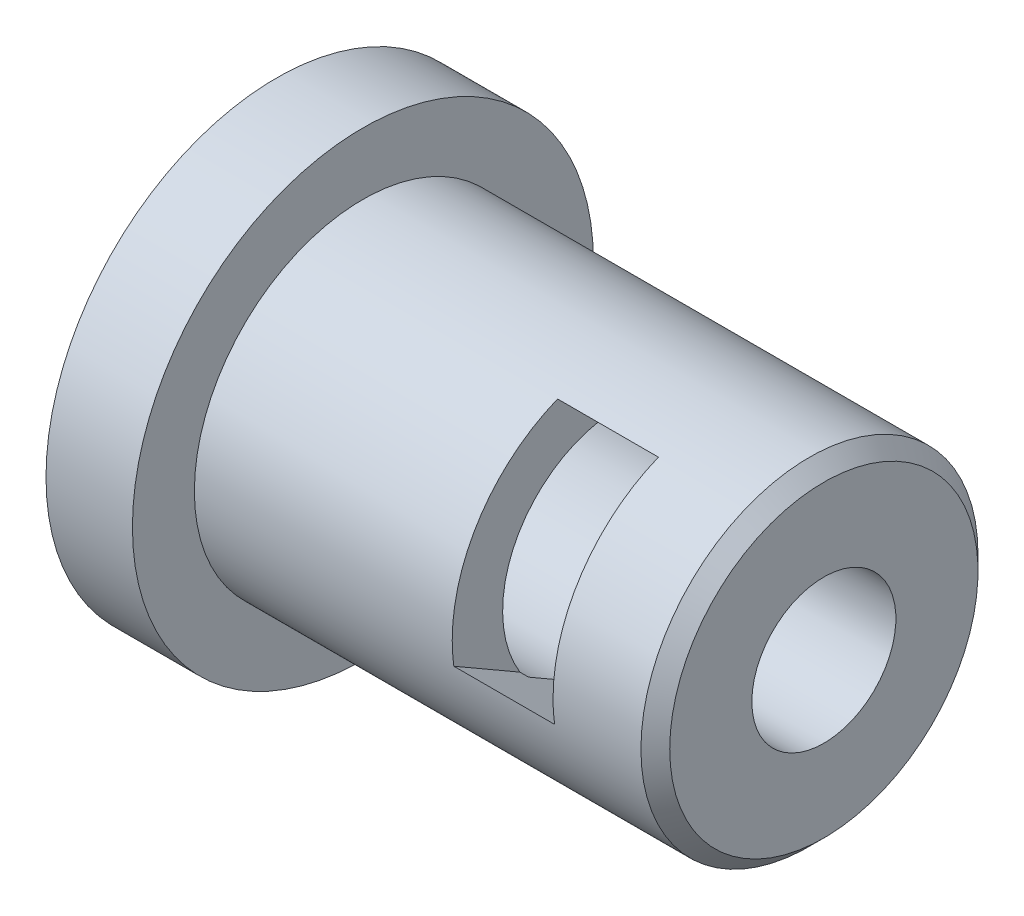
ISO-10303-21;
HEADER;
FILE_DESCRIPTION(('STEP AP214'),'2;1');
FILE_NAME('part.step','',(''),(''),'','','');
FILE_SCHEMA(('AUTOMOTIVE_DESIGN { 1 0 10303 214 1 1 1 1 }'));
ENDSEC;
DATA;
#1=APPLICATION_CONTEXT('core data for automotive mechanical design processes');
#2=APPLICATION_PROTOCOL_DEFINITION('international standard','automotive_design',2000,#1);
#3=PRODUCT_CONTEXT('',#1,'mechanical');
#4=PRODUCT('Part','Part','',(#3));
#5=PRODUCT_RELATED_PRODUCT_CATEGORY('part','',(#4));
#6=PRODUCT_DEFINITION_FORMATION('','',#4);
#7=PRODUCT_DEFINITION_CONTEXT('part definition',#1,'design');
#8=PRODUCT_DEFINITION('design','',#6,#7);
#9=PRODUCT_DEFINITION_SHAPE('','',#8);
#10=(LENGTH_UNIT() NAMED_UNIT(*) SI_UNIT(.MILLI.,.METRE.));
#11=(NAMED_UNIT(*) PLANE_ANGLE_UNIT() SI_UNIT($,.RADIAN.));
#12=(NAMED_UNIT(*) SI_UNIT($,.STERADIAN.) SOLID_ANGLE_UNIT());
#13=UNCERTAINTY_MEASURE_WITH_UNIT(LENGTH_MEASURE(1.E-05),#10,'distance_accuracy_value','');
#14=(GEOMETRIC_REPRESENTATION_CONTEXT(3) GLOBAL_UNCERTAINTY_ASSIGNED_CONTEXT((#13)) GLOBAL_UNIT_ASSIGNED_CONTEXT((#10,
#11,#12)) REPRESENTATION_CONTEXT('',''));
#15=CARTESIAN_POINT('',(0.,0.,0.));
#16=DIRECTION('',(0.,0.,1.));
#17=DIRECTION('',(1.,0.,0.));
#18=AXIS2_PLACEMENT_3D('',#15,#16,#17);
#19=CARTESIAN_POINT('',(-9.41062293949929,0.,0.));
#20=DIRECTION('',(-1.,0.,0.));
#21=DIRECTION('',(0.,0.,1.));
#22=AXIS2_PLACEMENT_3D('',#19,#20,#21);
#23=CYLINDRICAL_SURFACE('',#22,2.5);
#24=CARTESIAN_POINT('',(19.,0.,0.));
#25=DIRECTION('',(-1.,0.,0.));
#26=DIRECTION('',(0.,0.,1.));
#27=AXIS2_PLACEMENT_3D('',#24,#25,#26);
#28=CIRCLE('',#27,2.5);
#29=CARTESIAN_POINT('',(19.,0.,2.5));
#30=VERTEX_POINT('',#29);
#31=EDGE_CURVE('E226',#30,#30,#28,.T.);
#32=ORIENTED_EDGE('',*,*,#31,.F.);
#33=EDGE_LOOP('',(#32));
#34=FACE_BOUND('',#33,.T.);
#35=CARTESIAN_POINT('',(15.45,0.,0.));
#36=DIRECTION('',(-1.,0.,0.));
#37=DIRECTION('',(0.,-1.,0.));
#38=AXIS2_PLACEMENT_3D('',#35,#36,#37);
#39=CIRCLE('',#38,2.5);
#40=CARTESIAN_POINT('',(15.45,-2.5,0.));
#41=VERTEX_POINT('',#40);
#42=EDGE_CURVE('E214',#41,#41,#39,.F.);
#43=ORIENTED_EDGE('',*,*,#42,.F.);
#44=EDGE_LOOP('',(#43));
#45=FACE_BOUND('',#44,.T.);
#46=ADVANCED_FACE('F49',(#34,#45),#23,.F.);
#47=CARTESIAN_POINT('',(12.25,2.5,0.));
#48=DIRECTION('',(1.,0.,0.));
#49=DIRECTION('',(0.,0.,-1.));
#50=AXIS2_PLACEMENT_3D('',#47,#48,#49);
#51=PLANE('',#50);
#52=CARTESIAN_POINT('',(12.25,0.,0.));
#53=DIRECTION('',(-1.,0.,0.));
#54=DIRECTION('',(0.,0.,1.));
#55=AXIS2_PLACEMENT_3D('',#52,#53,#54);
#56=CIRCLE('',#55,4.1);
#57=CARTESIAN_POINT('',(12.25,-4.09876229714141,0.100735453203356));
#58=VERTEX_POINT('',#57);
#59=CARTESIAN_POINT('',(12.25,-2.13662061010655,3.49926454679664));
#60=VERTEX_POINT('',#59);
#61=EDGE_CURVE('E220',#58,#60,#56,.T.);
#62=ORIENTED_EDGE('',*,*,#61,.T.);
#63=DIRECTION('',(0.,-0.5,-0.866025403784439));
#64=VECTOR('',#63,1.);
#65=CARTESIAN_POINT('',(12.25,-2.49269145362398,2.88253175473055));
#66=LINE('',#65,#64);
#67=EDGE_CURVE('E269',#60,#58,#66,.T.);
#68=ORIENTED_EDGE('',*,*,#67,.T.);
#69=EDGE_LOOP('',(#62,#68));
#70=FACE_BOUND('',#69,.T.);
#71=ADVANCED_FACE('F372',(#70),#51,.F.);
#72=CARTESIAN_POINT('',(12.25,-2.13662061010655,-3.49926454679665));
#73=VERTEX_POINT('',#72);
#74=CARTESIAN_POINT('',(12.25,-4.09876229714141,-0.100735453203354));
#75=VERTEX_POINT('',#74);
#76=EDGE_CURVE('E224',#73,#75,#56,.T.);
#77=ORIENTED_EDGE('',*,*,#76,.T.);
#78=DIRECTION('',(0.,0.5,-0.866025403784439));
#79=VECTOR('',#78,1.);
#80=CARTESIAN_POINT('',(12.25,-2.49269145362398,-2.88253175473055));
#81=LINE('',#80,#79);
#82=EDGE_CURVE('E265',#75,#73,#81,.T.);
#83=ORIENTED_EDGE('',*,*,#82,.T.);
#84=EDGE_LOOP('',(#77,#83));
#85=FACE_BOUND('',#84,.T.);
#86=ADVANCED_FACE('F375',(#85),#51,.F.);
#87=CARTESIAN_POINT('',(12.25,1.96214168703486,-3.6));
#88=VERTEX_POINT('',#87);
#89=CARTESIAN_POINT('',(12.25,-1.96214168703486,-3.6));
#90=VERTEX_POINT('',#89);
#91=EDGE_CURVE('E449',#88,#90,#56,.T.);
#92=ORIENTED_EDGE('',*,*,#91,.T.);
#93=DIRECTION('',(0.,1.,0.));
#94=VECTOR('',#93,1.);
#95=CARTESIAN_POINT('',(12.25,2.5,-3.6));
#96=LINE('',#95,#94);
#97=EDGE_CURVE('E261',#90,#88,#96,.T.);
#98=ORIENTED_EDGE('',*,*,#97,.T.);
#99=EDGE_LOOP('',(#92,#98));
#100=FACE_BOUND('',#99,.T.);
#101=ADVANCED_FACE('F452',(#100),#51,.F.);
#102=CARTESIAN_POINT('',(12.25,4.09876229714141,-0.100735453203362));
#103=VERTEX_POINT('',#102);
#104=CARTESIAN_POINT('',(12.25,2.13662061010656,-3.49926454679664));
#105=VERTEX_POINT('',#104);
#106=EDGE_CURVE('E225',#103,#105,#56,.T.);
#107=ORIENTED_EDGE('',*,*,#106,.T.);
#108=DIRECTION('',(0.,0.5,0.866025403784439));
#109=VECTOR('',#108,1.);
#110=CARTESIAN_POINT('',(12.25,3.74269145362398,-0.717468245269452));
#111=LINE('',#110,#109);
#112=EDGE_CURVE('E258',#105,#103,#111,.T.);
#113=ORIENTED_EDGE('',*,*,#112,.T.);
#114=EDGE_LOOP('',(#107,#113));
#115=FACE_BOUND('',#114,.T.);
#116=ADVANCED_FACE('F377',(#115),#51,.F.);
#117=CARTESIAN_POINT('',(-9.41062293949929,0.,0.));
#118=DIRECTION('',(-1.,0.,0.));
#119=DIRECTION('',(0.,0.,1.));
#120=AXIS2_PLACEMENT_3D('',#117,#118,#119);
#121=CYLINDRICAL_SURFACE('',#120,4.1);
#122=CARTESIAN_POINT('',(0.500000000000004,0.,0.));
#123=DIRECTION('',(1.,0.,0.));
#124=DIRECTION('',(0.,0.,-1.));
#125=AXIS2_PLACEMENT_3D('',#122,#123,#124);
#126=CIRCLE('',#125,4.1);
#127=CARTESIAN_POINT('',(0.500000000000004,0.,-4.1));
#128=VERTEX_POINT('',#127);
#129=EDGE_CURVE('E250',#128,#128,#126,.F.);
#130=ORIENTED_EDGE('',*,*,#129,.T.);
#131=EDGE_LOOP('',(#130));
#132=FACE_BOUND('',#131,.T.);
#133=ORIENTED_EDGE('',*,*,#91,.F.);
#134=DIRECTION('',(-1.,0.,0.));
#135=VECTOR('',#134,1.);
#136=CARTESIAN_POINT('',(12.25,1.96214168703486,-3.6));
#137=LINE('',#136,#135);
#138=CARTESIAN_POINT('',(11.25,1.96214168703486,-3.6));
#139=VERTEX_POINT('',#138);
#140=EDGE_CURVE('E99',#88,#139,#137,.T.);
#141=ORIENTED_EDGE('',*,*,#140,.T.);
#142=CARTESIAN_POINT('',(11.25,0.,0.));
#143=DIRECTION('',(-1.,0.,0.));
#144=DIRECTION('',(0.,0.,1.));
#145=AXIS2_PLACEMENT_3D('',#142,#143,#144);
#146=CIRCLE('',#145,4.1);
#147=CARTESIAN_POINT('',(11.25,2.13662061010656,-3.49926454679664));
#148=VERTEX_POINT('',#147);
#149=EDGE_CURVE('E302',#139,#148,#146,.F.);
#150=ORIENTED_EDGE('',*,*,#149,.T.);
#151=DIRECTION('',(-1.,0.,0.));
#152=VECTOR('',#151,1.);
#153=CARTESIAN_POINT('',(11.25,2.13662061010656,-3.49926454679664));
#154=LINE('',#153,#152);
#155=EDGE_CURVE('E299',#148,#105,#154,.F.);
#156=ORIENTED_EDGE('',*,*,#155,.T.);
#157=ORIENTED_EDGE('',*,*,#106,.F.);
#158=DIRECTION('',(-1.,0.,0.));
#159=VECTOR('',#158,1.);
#160=CARTESIAN_POINT('',(-9.41062293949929,4.09876229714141,-0.100735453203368));
#161=LINE('',#160,#159);
#162=CARTESIAN_POINT('',(11.95,4.0987622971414,-0.100735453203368));
#163=VERTEX_POINT('',#162);
#164=EDGE_CURVE('E182',#103,#163,#161,.T.);
#165=ORIENTED_EDGE('',*,*,#164,.T.);
#166=CARTESIAN_POINT('',(11.95,0.,0.));
#167=DIRECTION('',(-1.,0.,0.));
#168=DIRECTION('',(0.,-1.,0.));
#169=AXIS2_PLACEMENT_3D('',#166,#167,#168);
#170=CIRCLE('',#169,4.1);
#171=CARTESIAN_POINT('',(11.95,-2.13662061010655,3.49926454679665));
#172=VERTEX_POINT('',#171);
#173=EDGE_CURVE('E171',#163,#172,#170,.F.);
#174=ORIENTED_EDGE('',*,*,#173,.T.);
#175=DIRECTION('',(-1.,0.,0.));
#176=VECTOR('',#175,1.);
#177=CARTESIAN_POINT('',(-9.41062293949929,-2.13662061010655,3.49926454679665));
#178=LINE('',#177,#176);
#179=EDGE_CURVE('E183',#172,#60,#178,.F.);
#180=ORIENTED_EDGE('',*,*,#179,.T.);
#181=ORIENTED_EDGE('',*,*,#61,.F.);
#182=DIRECTION('',(-1.,0.,0.));
#183=VECTOR('',#182,1.);
#184=CARTESIAN_POINT('',(12.25,-4.09876229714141,0.100735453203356));
#185=LINE('',#184,#183);
#186=CARTESIAN_POINT('',(11.25,-4.09876229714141,0.100735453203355));
#187=VERTEX_POINT('',#186);
#188=EDGE_CURVE('E78',#58,#187,#185,.T.);
#189=ORIENTED_EDGE('',*,*,#188,.T.);
#190=CARTESIAN_POINT('',(11.25,0.,0.));
#191=DIRECTION('',(-1.,0.,0.));
#192=DIRECTION('',(0.,0.,1.));
#193=AXIS2_PLACEMENT_3D('',#190,#191,#192);
#194=CIRCLE('',#193,4.1);
#195=CARTESIAN_POINT('',(11.25,-4.09876229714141,-0.100735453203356));
#196=VERTEX_POINT('',#195);
#197=EDGE_CURVE('E282',#187,#196,#194,.F.);
#198=ORIENTED_EDGE('',*,*,#197,.T.);
#199=DIRECTION('',(-1.,0.,0.));
#200=VECTOR('',#199,1.);
#201=CARTESIAN_POINT('',(11.25,-4.09876229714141,-0.100735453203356));
#202=LINE('',#201,#200);
#203=EDGE_CURVE('E279',#196,#75,#202,.F.);
#204=ORIENTED_EDGE('',*,*,#203,.T.);
#205=ORIENTED_EDGE('',*,*,#76,.F.);
#206=DIRECTION('',(-1.,0.,0.));
#207=VECTOR('',#206,1.);
#208=CARTESIAN_POINT('',(12.25,-2.13662061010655,-3.49926454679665));
#209=LINE('',#208,#207);
#210=CARTESIAN_POINT('',(11.25,-2.13662061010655,-3.49926454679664));
#211=VERTEX_POINT('',#210);
#212=EDGE_CURVE('E295',#73,#211,#209,.T.);
#213=ORIENTED_EDGE('',*,*,#212,.T.);
#214=CARTESIAN_POINT('',(11.25,0.,0.));
#215=DIRECTION('',(-1.,0.,0.));
#216=DIRECTION('',(0.,0.,1.));
#217=AXIS2_PLACEMENT_3D('',#214,#215,#216);
#218=CIRCLE('',#217,4.1);
#219=CARTESIAN_POINT('',(11.25,-1.96214168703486,-3.6));
#220=VERTEX_POINT('',#219);
#221=EDGE_CURVE('E291',#211,#220,#218,.F.);
#222=ORIENTED_EDGE('',*,*,#221,.T.);
#223=DIRECTION('',(-1.,0.,0.));
#224=VECTOR('',#223,1.);
#225=CARTESIAN_POINT('',(11.25,-1.96214168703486,-3.6));
#226=LINE('',#225,#224);
#227=EDGE_CURVE('E288',#220,#90,#226,.F.);
#228=ORIENTED_EDGE('',*,*,#227,.T.);
#229=EDGE_LOOP('',(#133,#141,#150,#156,#157,#165,#174,#180,#181,#189,#198,#204,#205,#213,#222,#228));
#230=FACE_BOUND('',#229,.T.);
#231=ADVANCED_FACE('F399',(#132,#230),#121,.F.);
#232=CARTESIAN_POINT('',(0.,4.1,0.));
#233=DIRECTION('',(1.,0.,0.));
#234=DIRECTION('',(0.,0.,-1.));
#235=AXIS2_PLACEMENT_3D('',#232,#233,#234);
#236=PLANE('',#235);
#237=CARTESIAN_POINT('',(0.,0.,0.));
#238=DIRECTION('',(1.,0.,0.));
#239=DIRECTION('',(0.,0.,-1.));
#240=AXIS2_PLACEMENT_3D('',#237,#238,#239);
#241=CIRCLE('',#240,4.60000000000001);
#242=CARTESIAN_POINT('',(0.,0.,-4.60000000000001));
#243=VERTEX_POINT('',#242);
#244=EDGE_CURVE('E254',#243,#243,#241,.T.);
#245=ORIENTED_EDGE('',*,*,#244,.T.);
#246=EDGE_LOOP('',(#245));
#247=FACE_BOUND('',#246,.T.);
#248=CARTESIAN_POINT('',(0.,0.,0.));
#249=DIRECTION('',(-1.,0.,0.));
#250=DIRECTION('',(0.,0.,1.));
#251=AXIS2_PLACEMENT_3D('',#248,#249,#250);
#252=CIRCLE('',#251,8.);
#253=CARTESIAN_POINT('',(0.,0.,8.));
#254=VERTEX_POINT('',#253);
#255=EDGE_CURVE('E238',#254,#254,#252,.T.);
#256=ORIENTED_EDGE('',*,*,#255,.T.);
#257=EDGE_LOOP('',(#256));
#258=FACE_BOUND('',#257,.T.);
#259=ADVANCED_FACE('F395',(#247,#258),#236,.F.);
#260=CARTESIAN_POINT('',(-9.41062293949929,0.,0.));
#261=DIRECTION('',(-1.,0.,0.));
#262=DIRECTION('',(0.,0.,1.));
#263=AXIS2_PLACEMENT_3D('',#260,#261,#262);
#264=CYLINDRICAL_SURFACE('',#263,8.);
#265=ORIENTED_EDGE('',*,*,#255,.F.);
#266=EDGE_LOOP('',(#265));
#267=FACE_BOUND('',#266,.T.);
#268=CARTESIAN_POINT('',(3.,0.,0.));
#269=DIRECTION('',(-1.,0.,0.));
#270=DIRECTION('',(0.,0.,1.));
#271=AXIS2_PLACEMENT_3D('',#268,#269,#270);
#272=CIRCLE('',#271,8.);
#273=CARTESIAN_POINT('',(3.,0.,8.));
#274=VERTEX_POINT('',#273);
#275=EDGE_CURVE('E234',#274,#274,#272,.T.);
#276=ORIENTED_EDGE('',*,*,#275,.T.);
#277=EDGE_LOOP('',(#276));
#278=FACE_BOUND('',#277,.T.);
#279=ADVANCED_FACE('F391',(#267,#278),#264,.T.);
#280=CARTESIAN_POINT('',(3.,8.,0.));
#281=DIRECTION('',(-1.,0.,0.));
#282=DIRECTION('',(0.,0.,1.));
#283=AXIS2_PLACEMENT_3D('',#280,#281,#282);
#284=PLANE('',#283);
#285=ORIENTED_EDGE('',*,*,#275,.F.);
#286=EDGE_LOOP('',(#285));
#287=FACE_BOUND('',#286,.T.);
#288=CARTESIAN_POINT('',(3.,0.,0.));
#289=DIRECTION('',(-1.,0.,0.));
#290=DIRECTION('',(0.,0.,1.));
#291=AXIS2_PLACEMENT_3D('',#288,#289,#290);
#292=CIRCLE('',#291,5.85);
#293=CARTESIAN_POINT('',(3.,0.,5.85));
#294=VERTEX_POINT('',#293);
#295=EDGE_CURVE('E230',#294,#294,#292,.T.);
#296=ORIENTED_EDGE('',*,*,#295,.T.);
#297=EDGE_LOOP('',(#296));
#298=FACE_BOUND('',#297,.T.);
#299=ADVANCED_FACE('F388',(#287,#298),#284,.F.);
#300=CARTESIAN_POINT('',(-9.41062293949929,0.,0.));
#301=DIRECTION('',(-1.,0.,0.));
#302=DIRECTION('',(0.,0.,1.));
#303=AXIS2_PLACEMENT_3D('',#300,#301,#302);
#304=CYLINDRICAL_SURFACE('',#303,5.85);
#305=DIRECTION('',(-1.,0.,0.));
#306=VECTOR('',#305,1.);
#307=CARTESIAN_POINT('',(-9.41062293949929,-0.812127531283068,5.79335385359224));
#308=LINE('',#307,#306);
#309=CARTESIAN_POINT('',(15.45,-0.812127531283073,5.79335385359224));
#310=VERTEX_POINT('',#309);
#311=CARTESIAN_POINT('',(11.95,-0.81212753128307,5.79335385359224));
#312=VERTEX_POINT('',#311);
#313=EDGE_CURVE('E175',#310,#312,#308,.T.);
#314=ORIENTED_EDGE('',*,*,#313,.T.);
#315=CARTESIAN_POINT('',(11.95,0.,0.));
#316=DIRECTION('',(-1.,0.,0.));
#317=DIRECTION('',(0.,-1.,0.));
#318=AXIS2_PLACEMENT_3D('',#315,#316,#317);
#319=CIRCLE('',#318,5.85);
#320=CARTESIAN_POINT('',(11.95,5.42325537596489,2.19335385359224));
#321=VERTEX_POINT('',#320);
#322=EDGE_CURVE('E273',#312,#321,#319,.T.);
#323=ORIENTED_EDGE('',*,*,#322,.T.);
#324=DIRECTION('',(-1.,0.,0.));
#325=VECTOR('',#324,1.);
#326=CARTESIAN_POINT('',(-9.41062293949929,5.42325537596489,2.19335385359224));
#327=LINE('',#326,#325);
#328=CARTESIAN_POINT('',(15.45,5.42325537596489,2.19335385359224));
#329=VERTEX_POINT('',#328);
#330=EDGE_CURVE('E187',#321,#329,#327,.F.);
#331=ORIENTED_EDGE('',*,*,#330,.T.);
#332=CARTESIAN_POINT('',(15.45,0.,0.));
#333=DIRECTION('',(1.,0.,0.));
#334=DIRECTION('',(0.,1.,0.));
#335=AXIS2_PLACEMENT_3D('',#332,#333,#334);
#336=CIRCLE('',#335,5.85);
#337=EDGE_CURVE('E164',#329,#310,#336,.T.);
#338=ORIENTED_EDGE('',*,*,#337,.T.);
#339=EDGE_LOOP('',(#314,#323,#331,#338));
#340=FACE_BOUND('',#339,.T.);
#341=CARTESIAN_POINT('',(18.5,0.,0.));
#342=DIRECTION('',(-1.,0.,0.));
#343=DIRECTION('',(0.,0.,1.));
#344=AXIS2_PLACEMENT_3D('',#341,#342,#343);
#345=CIRCLE('',#344,5.85);
#346=CARTESIAN_POINT('',(18.5,0.,5.85));
#347=VERTEX_POINT('',#346);
#348=EDGE_CURVE('E242',#347,#347,#345,.T.);
#349=ORIENTED_EDGE('',*,*,#348,.T.);
#350=EDGE_LOOP('',(#349));
#351=FACE_BOUND('',#350,.T.);
#352=ORIENTED_EDGE('',*,*,#295,.F.);
#353=EDGE_LOOP('',(#352));
#354=FACE_BOUND('',#353,.T.);
#355=ADVANCED_FACE('F185',(#340,#351,#354),#304,.T.);
#356=CARTESIAN_POINT('',(19.,5.85,0.));
#357=DIRECTION('',(-1.,0.,0.));
#358=DIRECTION('',(0.,0.,1.));
#359=AXIS2_PLACEMENT_3D('',#356,#357,#358);
#360=PLANE('',#359);
#361=CARTESIAN_POINT('',(19.,0.,0.));
#362=DIRECTION('',(-1.,0.,0.));
#363=DIRECTION('',(0.,0.,1.));
#364=AXIS2_PLACEMENT_3D('',#361,#362,#363);
#365=CIRCLE('',#364,5.34999999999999);
#366=CARTESIAN_POINT('',(19.,0.,5.34999999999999));
#367=VERTEX_POINT('',#366);
#368=EDGE_CURVE('E246',#367,#367,#365,.F.);
#369=ORIENTED_EDGE('',*,*,#368,.T.);
#370=EDGE_LOOP('',(#369));
#371=FACE_BOUND('',#370,.T.);
#372=ORIENTED_EDGE('',*,*,#31,.T.);
#373=EDGE_LOOP('',(#372));
#374=FACE_BOUND('',#373,.T.);
#375=ADVANCED_FACE('F381',(#371,#374),#360,.F.);
#376=CARTESIAN_POINT('',(18.5,0.,0.));
#377=DIRECTION('',(-1.,0.,0.));
#378=DIRECTION('',(0.,0.,1.));
#379=AXIS2_PLACEMENT_3D('',#376,#377,#378);
#380=CONICAL_SURFACE('',#379,5.85,0.785398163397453);
#381=ORIENTED_EDGE('',*,*,#368,.F.);
#382=EDGE_LOOP('',(#381));
#383=FACE_BOUND('',#382,.T.);
#384=ORIENTED_EDGE('',*,*,#348,.F.);
#385=EDGE_LOOP('',(#384));
#386=FACE_BOUND('',#385,.T.);
#387=ADVANCED_FACE('F384',(#383,#386),#380,.T.);
#388=CARTESIAN_POINT('',(0.500000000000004,0.,0.));
#389=DIRECTION('',(-1.,0.,0.));
#390=DIRECTION('',(0.,0.,1.));
#391=AXIS2_PLACEMENT_3D('',#388,#389,#390);
#392=CONICAL_SURFACE('',#391,4.1,0.785398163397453);
#393=ORIENTED_EDGE('',*,*,#244,.F.);
#394=EDGE_LOOP('',(#393));
#395=FACE_BOUND('',#394,.T.);
#396=ORIENTED_EDGE('',*,*,#129,.F.);
#397=EDGE_LOOP('',(#396));
#398=FACE_BOUND('',#397,.T.);
#399=ADVANCED_FACE('F338',(#395,#398),#392,.F.);
#400=CARTESIAN_POINT('',(15.45,0.,0.));
#401=DIRECTION('',(-1.,0.,0.));
#402=DIRECTION('',(0.,-1.,0.));
#403=AXIS2_PLACEMENT_3D('',#400,#401,#402);
#404=PLANE('',#403);
#405=ORIENTED_EDGE('',*,*,#42,.T.);
#406=EDGE_LOOP('',(#405));
#407=FACE_BOUND('',#406,.T.);
#408=ORIENTED_EDGE('',*,*,#337,.F.);
#409=DIRECTION('',(0.,-0.5,-0.866025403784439));
#410=VECTOR('',#409,1.);
#411=CARTESIAN_POINT('',(15.45,4.15692193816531,0.));
#412=LINE('',#411,#410);
#413=CARTESIAN_POINT('',(15.45,2.07846096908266,-3.6));
#414=VERTEX_POINT('',#413);
#415=EDGE_CURVE('E170',#329,#414,#412,.T.);
#416=ORIENTED_EDGE('',*,*,#415,.T.);
#417=DIRECTION('',(0.,-1.,0.));
#418=VECTOR('',#417,1.);
#419=CARTESIAN_POINT('',(15.45,2.07846096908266,-3.6));
#420=LINE('',#419,#418);
#421=CARTESIAN_POINT('',(15.45,-2.07846096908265,-3.6));
#422=VERTEX_POINT('',#421);
#423=EDGE_CURVE('E207',#414,#422,#420,.T.);
#424=ORIENTED_EDGE('',*,*,#423,.T.);
#425=DIRECTION('',(0.,-0.5,0.866025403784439));
#426=VECTOR('',#425,1.);
#427=CARTESIAN_POINT('',(15.45,-2.07846096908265,-3.6));
#428=LINE('',#427,#426);
#429=CARTESIAN_POINT('',(15.45,-4.1569219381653,0.));
#430=VERTEX_POINT('',#429);
#431=EDGE_CURVE('E168',#422,#430,#428,.T.);
#432=ORIENTED_EDGE('',*,*,#431,.T.);
#433=DIRECTION('',(0.,0.5,0.866025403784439));
#434=VECTOR('',#433,1.);
#435=CARTESIAN_POINT('',(15.45,-4.1569219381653,0.));
#436=LINE('',#435,#434);
#437=EDGE_CURVE('E160',#430,#310,#436,.T.);
#438=ORIENTED_EDGE('',*,*,#437,.T.);
#439=EDGE_LOOP('',(#408,#416,#424,#432,#438));
#440=FACE_BOUND('',#439,.T.);
#441=ADVANCED_FACE('F162',(#407,#440),#404,.T.);
#442=CARTESIAN_POINT('',(15.45,-4.1569219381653,0.));
#443=DIRECTION('',(0.,-0.866025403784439,0.5));
#444=DIRECTION('',(0.,-0.5,-0.866025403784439));
#445=AXIS2_PLACEMENT_3D('',#442,#443,#444);
#446=PLANE('',#445);
#447=ORIENTED_EDGE('',*,*,#313,.F.);
#448=ORIENTED_EDGE('',*,*,#437,.F.);
#449=DIRECTION('',(-1.,0.,0.));
#450=VECTOR('',#449,1.);
#451=CARTESIAN_POINT('',(15.45,-4.1569219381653,0.));
#452=LINE('',#451,#450);
#453=CARTESIAN_POINT('',(11.3069219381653,-4.15692193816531,0.));
#454=VERTEX_POINT('',#453);
#455=EDGE_CURVE('E72',#430,#454,#452,.T.);
#456=ORIENTED_EDGE('',*,*,#455,.T.);
#457=CARTESIAN_POINT('',(11.3069219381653,-4.15692193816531,0.));
#458=CARTESIAN_POINT('',(11.2972643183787,-4.14726661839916,0.0167235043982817));
#459=CARTESIAN_POINT('',(11.2876905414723,-4.13759078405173,0.0334825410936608));
#460=CARTESIAN_POINT('',(11.2687166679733,-4.11820421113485,0.0670610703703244));
#461=CARTESIAN_POINT('',(11.2593164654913,-4.10849349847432,0.0838805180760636));
#462=CARTESIAN_POINT('',(11.25,-4.09876229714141,0.100735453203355));
#463=B_SPLINE_CURVE_WITH_KNOTS('',3,(#457,#458,#459,#460,#461,#462),.UNSPECIFIED.,.F.,.F.,(4,2,
4),(0.,0.0647711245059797,0.129501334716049),.UNSPECIFIED.);
#464=EDGE_CURVE('E65',#454,#187,#463,.T.);
#465=ORIENTED_EDGE('',*,*,#464,.T.);
#466=ORIENTED_EDGE('',*,*,#188,.F.);
#467=ORIENTED_EDGE('',*,*,#67,.F.);
#468=ORIENTED_EDGE('',*,*,#179,.F.);
#469=DIRECTION('',(0.,-0.5,-0.866025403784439));
#470=VECTOR('',#469,1.);
#471=CARTESIAN_POINT('',(11.95,2.34641016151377,11.2641016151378));
#472=LINE('',#471,#470);
#473=EDGE_CURVE('E178',#312,#172,#472,.T.);
#474=ORIENTED_EDGE('',*,*,#473,.F.);
#475=EDGE_LOOP('',(#447,#448,#456,#465,#466,#467,#468,#474));
#476=FACE_BOUND('',#475,.T.);
#477=ADVANCED_FACE('F176',(#476),#446,.F.);
#478=CARTESIAN_POINT('',(15.45,-2.07846096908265,-3.6));
#479=DIRECTION('',(0.,-0.866025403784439,-0.5));
#480=DIRECTION('',(0.,0.5,-0.866025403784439));
#481=AXIS2_PLACEMENT_3D('',#478,#479,#480);
#482=PLANE('',#481);
#483=DIRECTION('',(-1.,0.,0.));
#484=VECTOR('',#483,1.);
#485=CARTESIAN_POINT('',(15.45,-2.07846096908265,-3.6));
#486=LINE('',#485,#484);
#487=CARTESIAN_POINT('',(11.3069219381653,-2.07846096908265,-3.6));
#488=VERTEX_POINT('',#487);
#489=EDGE_CURVE('E215',#422,#488,#486,.T.);
#490=ORIENTED_EDGE('',*,*,#489,.T.);
#491=CARTESIAN_POINT('',(11.3069219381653,-2.07846096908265,-3.6));
#492=CARTESIAN_POINT('',(11.2972643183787,-2.08811628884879,-3.58327649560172));
#493=CARTESIAN_POINT('',(11.2876905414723,-2.09779212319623,-3.56651745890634));
#494=CARTESIAN_POINT('',(11.2687166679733,-2.1171786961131,-3.53293892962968));
#495=CARTESIAN_POINT('',(11.2593164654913,-2.12688940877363,-3.51611948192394));
#496=CARTESIAN_POINT('',(11.25,-2.13662061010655,-3.49926454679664));
#497=B_SPLINE_CURVE_WITH_KNOTS('',3,(#491,#492,#493,#494,#495,#496),.UNSPECIFIED.,.F.,.F.,(4,2,
4),(0.,0.0647711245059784,0.129501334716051),.UNSPECIFIED.);
#498=EDGE_CURVE('E347',#488,#211,#497,.T.);
#499=ORIENTED_EDGE('',*,*,#498,.T.);
#500=ORIENTED_EDGE('',*,*,#212,.F.);
#501=ORIENTED_EDGE('',*,*,#82,.F.);
#502=ORIENTED_EDGE('',*,*,#203,.F.);
#503=CARTESIAN_POINT('',(11.25,-4.09876229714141,-0.100735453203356));
#504=CARTESIAN_POINT('',(11.2593194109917,-4.10849657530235,-0.0838751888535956));
#505=CARTESIAN_POINT('',(11.2687226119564,-4.11821035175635,-0.0670504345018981));
#506=CARTESIAN_POINT('',(11.287696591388,-4.13759689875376,-0.0334719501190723));
#507=CARTESIAN_POINT('',(11.2972673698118,-4.14726966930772,-0.0167182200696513));
#508=CARTESIAN_POINT('',(11.3069219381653,-4.15692193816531,0.));
#509=B_SPLINE_CURVE_WITH_KNOTS('',3,(#503,#504,#505,#506,#507,#508),.UNSPECIFIED.,.F.,.F.,(4,2,
4),(0.,0.0647506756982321,0.129501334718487),.UNSPECIFIED.);
#510=EDGE_CURVE('E11',#196,#454,#509,.T.);
#511=ORIENTED_EDGE('',*,*,#510,.T.);
#512=ORIENTED_EDGE('',*,*,#455,.F.);
#513=ORIENTED_EDGE('',*,*,#431,.F.);
#514=EDGE_LOOP('',(#490,#499,#500,#501,#502,#511,#512,#513));
#515=FACE_BOUND('',#514,.T.);
#516=ADVANCED_FACE('F369',(#515),#482,.F.);
#517=CARTESIAN_POINT('',(15.45,2.07846096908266,-3.6));
#518=DIRECTION('',(0.,0.,-1.));
#519=DIRECTION('',(0.,1.,0.));
#520=AXIS2_PLACEMENT_3D('',#517,#518,#519);
#521=PLANE('',#520);
#522=DIRECTION('',(-1.,0.,0.));
#523=VECTOR('',#522,1.);
#524=CARTESIAN_POINT('',(15.45,2.07846096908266,-3.6));
#525=LINE('',#524,#523);
#526=CARTESIAN_POINT('',(11.3069219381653,2.07846096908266,-3.6));
#527=VERTEX_POINT('',#526);
#528=EDGE_CURVE('E92',#414,#527,#525,.T.);
#529=ORIENTED_EDGE('',*,*,#528,.T.);
#530=CARTESIAN_POINT('',(11.3069219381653,2.07846096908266,-3.6));
#531=CARTESIAN_POINT('',(11.2972643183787,2.05915032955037,-3.6));
#532=CARTESIAN_POINT('',(11.2876905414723,2.0397986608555,-3.6));
#533=CARTESIAN_POINT('',(11.2687166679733,2.00102551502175,-3.6));
#534=CARTESIAN_POINT('',(11.2593164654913,1.98160408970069,-3.6));
#535=CARTESIAN_POINT('',(11.25,1.96214168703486,-3.6));
#536=B_SPLINE_CURVE_WITH_KNOTS('',3,(#530,#531,#532,#533,#534,#535),.UNSPECIFIED.,.F.,.F.,(4,2,
4),(0.,0.0647711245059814,0.129501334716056),.UNSPECIFIED.);
#537=EDGE_CURVE('E308',#527,#139,#536,.T.);
#538=ORIENTED_EDGE('',*,*,#537,.T.);
#539=ORIENTED_EDGE('',*,*,#140,.F.);
#540=ORIENTED_EDGE('',*,*,#97,.F.);
#541=ORIENTED_EDGE('',*,*,#227,.F.);
#542=CARTESIAN_POINT('',(11.25,-1.96214168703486,-3.6));
#543=CARTESIAN_POINT('',(11.2593194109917,-1.98161024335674,-3.6));
#544=CARTESIAN_POINT('',(11.2687226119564,-2.00103779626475,-3.6));
#545=CARTESIAN_POINT('',(11.287696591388,-2.03981089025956,-3.6));
#546=CARTESIAN_POINT('',(11.2972673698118,-2.05915643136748,-3.6));
#547=CARTESIAN_POINT('',(11.3069219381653,-2.07846096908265,-3.6));
#548=B_SPLINE_CURVE_WITH_KNOTS('',3,(#542,#543,#544,#545,#546,#547),.UNSPECIFIED.,.F.,.F.,(4,2,
4),(0.,0.0647506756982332,0.12950133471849),.UNSPECIFIED.);
#549=EDGE_CURVE('E353',#220,#488,#548,.T.);
#550=ORIENTED_EDGE('',*,*,#549,.T.);
#551=ORIENTED_EDGE('',*,*,#489,.F.);
#552=ORIENTED_EDGE('',*,*,#423,.F.);
#553=EDGE_LOOP('',(#529,#538,#539,#540,#541,#550,#551,#552));
#554=FACE_BOUND('',#553,.T.);
#555=ADVANCED_FACE('F324',(#554),#521,.F.);
#556=CARTESIAN_POINT('',(15.45,4.15692193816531,0.));
#557=DIRECTION('',(0.,0.866025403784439,-0.5));
#558=DIRECTION('',(0.,0.5,0.866025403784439));
#559=AXIS2_PLACEMENT_3D('',#556,#557,#558);
#560=PLANE('',#559);
#561=ORIENTED_EDGE('',*,*,#164,.F.);
#562=ORIENTED_EDGE('',*,*,#112,.F.);
#563=ORIENTED_EDGE('',*,*,#155,.F.);
#564=CARTESIAN_POINT('',(11.25,2.13662061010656,-3.49926454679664));
#565=CARTESIAN_POINT('',(11.2593194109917,2.12688633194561,-3.5161248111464));
#566=CARTESIAN_POINT('',(11.2687226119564,2.11717255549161,-3.5329495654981));
#567=CARTESIAN_POINT('',(11.287696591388,2.09778600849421,-3.56652804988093));
#568=CARTESIAN_POINT('',(11.2972673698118,2.08811323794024,-3.58328177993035));
#569=CARTESIAN_POINT('',(11.3069219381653,2.07846096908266,-3.6));
#570=B_SPLINE_CURVE_WITH_KNOTS('',3,(#564,#565,#566,#567,#568,#569),.UNSPECIFIED.,.F.,.F.,(4,2,
4),(0.,0.0647506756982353,0.129501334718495),.UNSPECIFIED.);
#571=EDGE_CURVE('E317',#148,#527,#570,.T.);
#572=ORIENTED_EDGE('',*,*,#571,.T.);
#573=ORIENTED_EDGE('',*,*,#528,.F.);
#574=ORIENTED_EDGE('',*,*,#415,.F.);
#575=ORIENTED_EDGE('',*,*,#330,.F.);
#576=DIRECTION('',(0.,-0.5,-0.866025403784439));
#577=VECTOR('',#576,1.);
#578=CARTESIAN_POINT('',(11.95,8.58179306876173,7.66410161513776));
#579=LINE('',#578,#577);
#580=EDGE_CURVE('E193',#321,#163,#579,.T.);
#581=ORIENTED_EDGE('',*,*,#580,.T.);
#582=EDGE_LOOP('',(#561,#562,#563,#572,#573,#574,#575,#581));
#583=FACE_BOUND('',#582,.T.);
#584=ADVANCED_FACE('F370',(#583),#560,.F.);
#585=CARTESIAN_POINT('',(11.95,8.58179306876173,7.66410161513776));
#586=DIRECTION('',(-1.,0.,0.));
#587=DIRECTION('',(0.,-1.,0.));
#588=AXIS2_PLACEMENT_3D('',#585,#586,#587);
#589=PLANE('',#588);
#590=ORIENTED_EDGE('',*,*,#580,.F.);
#591=ORIENTED_EDGE('',*,*,#322,.F.);
#592=ORIENTED_EDGE('',*,*,#473,.T.);
#593=ORIENTED_EDGE('',*,*,#173,.F.);
#594=EDGE_LOOP('',(#590,#591,#592,#593));
#595=FACE_BOUND('',#594,.T.);
#596=ADVANCED_FACE('F336',(#595),#589,.F.);
#597=CARTESIAN_POINT('',(12.25,0.,0.));
#598=DIRECTION('',(1.,0.,0.));
#599=DIRECTION('',(0.,0.,-1.));
#600=AXIS2_PLACEMENT_3D('',#597,#598,#599);
#601=CONICAL_SURFACE('',#600,5.10000000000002,0.785398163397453);
#602=ORIENTED_EDGE('',*,*,#571,.F.);
#603=ORIENTED_EDGE('',*,*,#149,.F.);
#604=ORIENTED_EDGE('',*,*,#537,.F.);
#605=EDGE_LOOP('',(#602,#603,#604));
#606=FACE_BOUND('',#605,.T.);
#607=ADVANCED_FACE('F327',(#606),#601,.F.);
#608=CARTESIAN_POINT('',(12.25,0.,0.));
#609=DIRECTION('',(1.,0.,0.));
#610=DIRECTION('',(0.,0.,-1.));
#611=AXIS2_PLACEMENT_3D('',#608,#609,#610);
#612=CONICAL_SURFACE('',#611,5.10000000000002,0.785398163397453);
#613=ORIENTED_EDGE('',*,*,#549,.F.);
#614=ORIENTED_EDGE('',*,*,#221,.F.);
#615=ORIENTED_EDGE('',*,*,#498,.F.);
#616=EDGE_LOOP('',(#613,#614,#615));
#617=FACE_BOUND('',#616,.T.);
#618=ADVANCED_FACE('F335',(#617),#612,.F.);
#619=CARTESIAN_POINT('',(12.25,0.,0.));
#620=DIRECTION('',(1.,0.,0.));
#621=DIRECTION('',(0.,0.,-1.));
#622=AXIS2_PLACEMENT_3D('',#619,#620,#621);
#623=CONICAL_SURFACE('',#622,5.10000000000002,0.785398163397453);
#624=ORIENTED_EDGE('',*,*,#510,.F.);
#625=ORIENTED_EDGE('',*,*,#197,.F.);
#626=ORIENTED_EDGE('',*,*,#464,.F.);
#627=EDGE_LOOP('',(#624,#625,#626));
#628=FACE_BOUND('',#627,.T.);
#629=ADVANCED_FACE('F52',(#628),#623,.F.);
#630=CLOSED_SHELL('',(#46,#71,#86,#101,#116,#231,#259,#279,#299,#355,#375,#387,#399,#441,#477,
#516,#555,#584,#596,#607,#618,#629));
#631=MANIFOLD_SOLID_BREP('B2',#630);
#632=ADVANCED_BREP_SHAPE_REPRESENTATION('',(#18,#631),#14);
#633=SHAPE_DEFINITION_REPRESENTATION(#9,#632);
ENDSEC;
END-ISO-10303-21;
